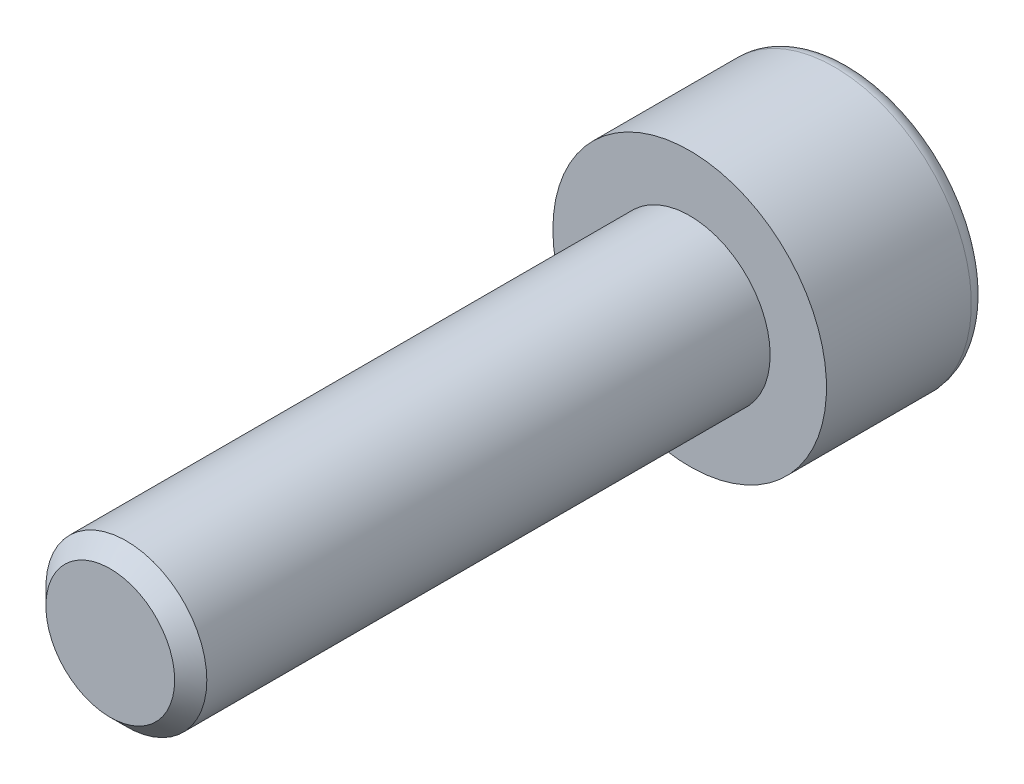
from build123d import *

# Parameters (mm, degrees)
ENLEV_MAT_EXTRU1_DEPTH = 2.5
ESQUISSE3_W            = 2.5
ESQUISSE3_H            = 18
CHANFREIN1_SIZE        = 0.5


with BuildPart() as part:
    # Esquisse1 → Base-R_volution (revolve)
    with BuildSketch(Plane(origin=(0, 0, 0), x_dir=(1, 0, 0), z_dir=(0, 1, 0)), mode=Mode.PRIVATE) as base_r_volution_sk:
        with BuildLine():
            Line((0, 0), (4.25, 0))
            Line((4.25, 0), (4.25, 4.5))
            ThreePointArc((4.25, 4.5), (4.103553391, 4.853553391), (3.75, 5))
            Line((3.75, 5), (0, 5))
            Line((0, 5), (0, 0))
        make_face()
    revolve(base_r_volution_sk.sketch.rotate(Axis((0, 0, 0), (0, 0, -1)), 180), axis=Axis((0, 0, 0), (0, 0, -1)))

    # Esquisse2 → enlev-mat-Extru1 (cut)
    with BuildSketch(Plane.XY.offset(-5)):
        Polygon((2, -1.154700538), (2, 1.154700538), (0, 2.309401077), (-2, 1.154700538), (-2, -1.154700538), (0, -2.309401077), align=None)
    extrude(amount=ENLEV_MAT_EXTRU1_DEPTH, mode=Mode.SUBTRACT)

    # Esquisse3 → Boss.-R_vol.1 (revolve)
    with BuildSketch(Plane(origin=(0, 0, 0), x_dir=(1, 0, 0), z_dir=(0, 1, 0))):
        with Locations((1.25, -9)):
            Rectangle(ESQUISSE3_W, ESQUISSE3_H)
    revolve(axis=Axis((0, 0, 0), (0, 0, 1)))

    # Chanfrein1
    chanfrein1_edges = [part.edges().sort_by_distance(p)[0] for p in [
        (-2.5, 0, 18),
    ]]
    chamfer(chanfrein1_edges, length=CHANFREIN1_SIZE)


solid = part.part
